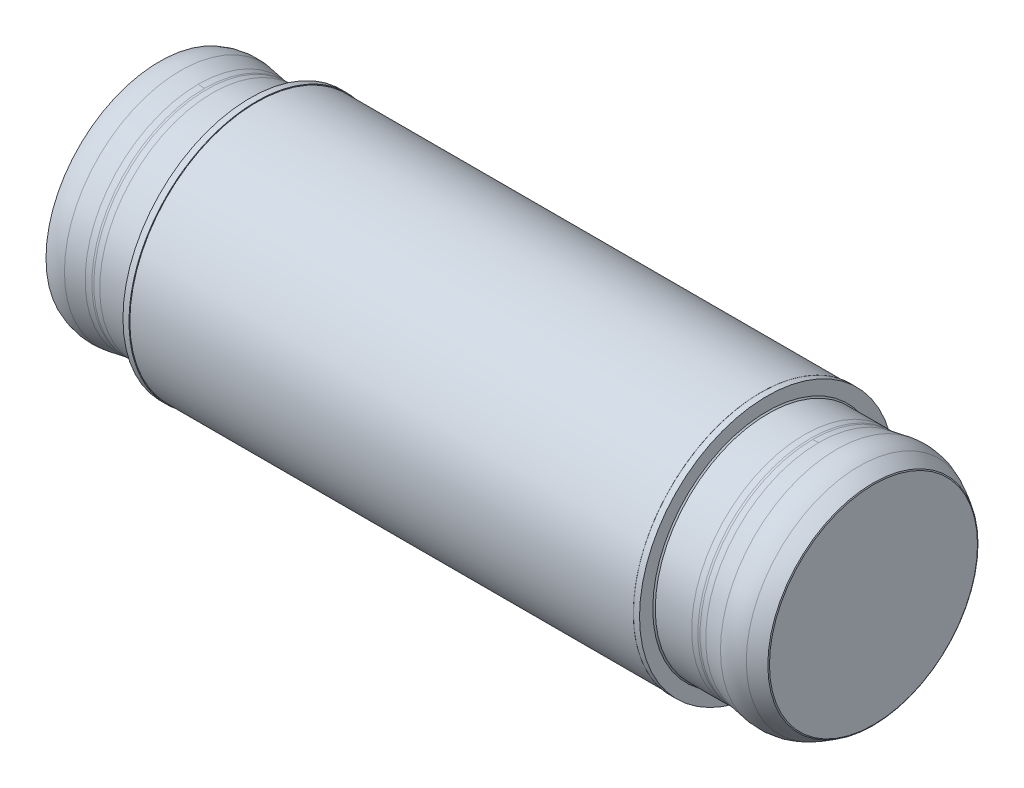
ISO-10303-21;
HEADER;
FILE_DESCRIPTION(('STEP AP214'),'2;1');
FILE_NAME('part.step','',(''),(''),'','','');
FILE_SCHEMA(('AUTOMOTIVE_DESIGN { 1 0 10303 214 1 1 1 1 }'));
ENDSEC;
DATA;
#1=APPLICATION_CONTEXT('core data for automotive mechanical design processes');
#2=APPLICATION_PROTOCOL_DEFINITION('international standard','automotive_design',2000,#1);
#3=PRODUCT_CONTEXT('',#1,'mechanical');
#4=PRODUCT('Part','Part','',(#3));
#5=PRODUCT_RELATED_PRODUCT_CATEGORY('part','',(#4));
#6=PRODUCT_DEFINITION_FORMATION('','',#4);
#7=PRODUCT_DEFINITION_CONTEXT('part definition',#1,'design');
#8=PRODUCT_DEFINITION('design','',#6,#7);
#9=PRODUCT_DEFINITION_SHAPE('','',#8);
#10=(LENGTH_UNIT() NAMED_UNIT(*) SI_UNIT(.MILLI.,.METRE.));
#11=(NAMED_UNIT(*) PLANE_ANGLE_UNIT() SI_UNIT($,.RADIAN.));
#12=(NAMED_UNIT(*) SI_UNIT($,.STERADIAN.) SOLID_ANGLE_UNIT());
#13=UNCERTAINTY_MEASURE_WITH_UNIT(LENGTH_MEASURE(1.E-05),#10,'distance_accuracy_value','');
#14=(GEOMETRIC_REPRESENTATION_CONTEXT(3) GLOBAL_UNCERTAINTY_ASSIGNED_CONTEXT((#13)) GLOBAL_UNIT_ASSIGNED_CONTEXT((#10,
#11,#12)) REPRESENTATION_CONTEXT('',''));
#15=CARTESIAN_POINT('',(0.,0.,0.));
#16=DIRECTION('',(0.,0.,1.));
#17=DIRECTION('',(1.,0.,0.));
#18=AXIS2_PLACEMENT_3D('',#15,#16,#17);
#19=CARTESIAN_POINT('',(527.01861007,83.959351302,-83.959351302));
#20=DIRECTION('',(-1.,0.,0.));
#21=DIRECTION('',(0.,-1.,0.));
#22=AXIS2_PLACEMENT_3D('',#19,#20,#21);
#23=PLANE('',#22);
#24=CARTESIAN_POINT('',(527.01861007,0.,0.));
#25=DIRECTION('',(-1.,0.,0.));
#26=DIRECTION('',(0.,0.,1.));
#27=AXIS2_PLACEMENT_3D('',#24,#25,#26);
#28=CIRCLE('',#27,82.963785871);
#29=CARTESIAN_POINT('',(527.01861007,0.,82.963785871));
#30=VERTEX_POINT('',#29);
#31=EDGE_CURVE('E20',#30,#30,#28,.F.);
#32=ORIENTED_EDGE('',*,*,#31,.T.);
#33=EDGE_LOOP('',(#32));
#34=FACE_BOUND('',#33,.T.);
#35=ADVANCED_FACE('F16',(#34),#23,.F.);
#36=CARTESIAN_POINT('',(527.01861007,0.,0.));
#37=DIRECTION('',(-1.,0.,0.));
#38=DIRECTION('',(0.,0.,1.));
#39=AXIS2_PLACEMENT_3D('',#36,#37,#38);
#40=CONICAL_SURFACE('',#39,82.963785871,1.0739759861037);
#41=CARTESIAN_POINT('',(526.564253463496,0.,0.));
#42=DIRECTION('',(-1.,0.,0.));
#43=DIRECTION('',(0.,1.,0.));
#44=AXIS2_PLACEMENT_3D('',#41,#42,#43);
#45=CIRCLE('',#44,83.8018033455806);
#46=CARTESIAN_POINT('',(526.564253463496,83.8018033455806,0.));
#47=VERTEX_POINT('',#46);
#48=EDGE_CURVE('E123',#47,#47,#45,.F.);
#49=ORIENTED_EDGE('',*,*,#48,.T.);
#50=EDGE_LOOP('',(#49));
#51=FACE_BOUND('',#50,.T.);
#52=ORIENTED_EDGE('',*,*,#31,.F.);
#53=EDGE_LOOP('',(#52));
#54=FACE_BOUND('',#53,.T.);
#55=ADVANCED_FACE('F133',(#51,#54),#40,.T.);
#56=CARTESIAN_POINT('',(472.,0.,0.));
#57=DIRECTION('',(-1.,0.,0.));
#58=DIRECTION('',(0.,-1.,0.));
#59=AXIS2_PLACEMENT_3D('',#56,#57,#58);
#60=SPHERICAL_SURFACE('',#59,100.);
#61=ORIENTED_EDGE('',*,*,#48,.F.);
#62=EDGE_LOOP('',(#61));
#63=FACE_BOUND('',#62,.T.);
#64=CARTESIAN_POINT('',(515.585097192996,0.,0.));
#65=DIRECTION('',(-1.,0.,0.));
#66=DIRECTION('',(0.,0.,1.));
#67=AXIS2_PLACEMENT_3D('',#64,#65,#66);
#68=CIRCLE('',#67,90.0018849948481);
#69=CARTESIAN_POINT('',(515.585097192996,0.,90.0018849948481));
#70=VERTEX_POINT('',#69);
#71=EDGE_CURVE('E119',#70,#70,#68,.T.);
#72=ORIENTED_EDGE('',*,*,#71,.F.);
#73=EDGE_LOOP('',(#72));
#74=FACE_BOUND('',#73,.T.);
#75=ADVANCED_FACE('F128',(#63,#74),#60,.T.);
#76=CARTESIAN_POINT('',(502.509568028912,0.,0.));
#77=DIRECTION('',(-1.,0.,0.));
#78=DIRECTION('',(0.,0.,1.));
#79=AXIS2_PLACEMENT_3D('',#76,#77,#78);
#80=TOROIDAL_SURFACE('',#79,63.0013194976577,30.0000000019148);
#81=CARTESIAN_POINT('',(497.571353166,0.,0.));
#82=DIRECTION('',(1.,0.,0.));
#83=DIRECTION('',(0.,1.,0.));
#84=AXIS2_PLACEMENT_3D('',#81,#82,#83);
#85=CIRCLE('',#84,92.592095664);
#86=CARTESIAN_POINT('',(497.571353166,92.592095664,0.));
#87=VERTEX_POINT('',#86);
#88=EDGE_CURVE('E87',#87,#87,#85,.T.);
#89=ORIENTED_EDGE('',*,*,#88,.T.);
#90=EDGE_LOOP('',(#89));
#91=FACE_BOUND('',#90,.T.);
#92=ORIENTED_EDGE('',*,*,#71,.T.);
#93=EDGE_LOOP('',(#92));
#94=FACE_BOUND('',#93,.T.);
#95=ADVANCED_FACE('F132',(#91,#94),#80,.T.);
#96=CARTESIAN_POINT('',(483.436161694,0.,0.));
#97=DIRECTION('',(1.,0.,0.));
#98=DIRECTION('',(0.,0.,-1.));
#99=AXIS2_PLACEMENT_3D('',#96,#97,#98);
#100=CONICAL_SURFACE('',#99,90.233164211,0.165359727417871);
#101=ORIENTED_EDGE('',*,*,#88,.F.);
#102=EDGE_LOOP('',(#101));
#103=FACE_BOUND('',#102,.T.);
#104=CARTESIAN_POINT('',(483.436161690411,0.,0.));
#105=DIRECTION('',(1.,0.,0.));
#106=DIRECTION('',(0.,0.,-1.));
#107=AXIS2_PLACEMENT_3D('',#104,#105,#106);
#108=CIRCLE('',#107,90.2331642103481);
#109=CARTESIAN_POINT('',(483.436161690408,90.2331642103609,0.));
#110=VERTEX_POINT('',#109);
#111=CARTESIAN_POINT('',(483.436161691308,-90.2331642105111,-9.25356567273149E-09));
#112=VERTEX_POINT('',#111);
#113=EDGE_CURVE('E85',#110,#112,#108,.T.);
#114=ORIENTED_EDGE('',*,*,#113,.T.);
#115=CARTESIAN_POINT('',(483.436161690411,0.,0.));
#116=DIRECTION('',(1.,0.,0.));
#117=DIRECTION('',(0.,0.,-1.));
#118=AXIS2_PLACEMENT_3D('',#115,#116,#117);
#119=CIRCLE('',#118,90.2331642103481);
#120=EDGE_CURVE('E79',#112,#110,#119,.T.);
#121=ORIENTED_EDGE('',*,*,#120,.T.);
#122=EDGE_LOOP('',(#114,#121));
#123=FACE_BOUND('',#122,.T.);
#124=ADVANCED_FACE('F84',(#103,#123),#100,.T.);
#125=CARTESIAN_POINT('',(486.365639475,90.8739937,0.));
#126=CARTESIAN_POINT('',(486.365639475,90.8739937,-181.7479874));
#127=CARTESIAN_POINT('',(486.365639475,-90.8739937,-181.7479874));
#128=CARTESIAN_POINT('',(486.365639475,-90.8739937,0.));
#129=CARTESIAN_POINT('',(482.820171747,89.910446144,0.));
#130=CARTESIAN_POINT('',(482.820171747,89.910446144,-179.820892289));
#131=CARTESIAN_POINT('',(482.820171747,-89.910446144,-179.820892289));
#132=CARTESIAN_POINT('',(482.820171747,-89.910446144,0.));
#133=CARTESIAN_POINT('',(479.158655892,89.607020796,0.));
#134=CARTESIAN_POINT('',(479.158655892,89.607020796,-179.214041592));
#135=CARTESIAN_POINT('',(479.158655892,-89.607020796,-179.214041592));
#136=CARTESIAN_POINT('',(479.158655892,-89.607020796,0.));
#137=CARTESIAN_POINT('',(475.502944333,89.973815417,0.));
#138=CARTESIAN_POINT('',(475.502944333,89.973815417,-179.947630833));
#139=CARTESIAN_POINT('',(475.502944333,-89.973815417,-179.947630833));
#140=CARTESIAN_POINT('',(475.502944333,-89.973815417,0.));
#141=(BOUNDED_SURFACE() B_SPLINE_SURFACE(3,3,((#125,#126,#127,#128),(#129,#130,#131,#132),(#133,
#134,#135,#136),(#137,#138,#139,#140)),.UNSPECIFIED.,.F.,.F.,
.F.) B_SPLINE_SURFACE_WITH_KNOTS((4,4),(4,4),(0.,1.),(0.,1.),
.UNSPECIFIED.) GEOMETRIC_REPRESENTATION_ITEM() RATIONAL_B_SPLINE_SURFACE(((1.,0.333333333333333,
0.333333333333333,1.),(0.988906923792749,0.32963564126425,0.32963564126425,0.988906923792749),
(0.988906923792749,0.32963564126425,0.32963564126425,0.988906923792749),(1.,0.333333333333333,
0.333333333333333,1.))) REPRESENTATION_ITEM('') SURFACE());
#142=CARTESIAN_POINT('',(486.365639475,90.8739937,0.));
#143=CARTESIAN_POINT('',(482.820171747,89.910446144,0.));
#144=CARTESIAN_POINT('',(479.158655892,89.607020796,0.));
#145=CARTESIAN_POINT('',(475.502944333,89.973815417,0.));
#146=(BOUNDED_CURVE() B_SPLINE_CURVE(3,(#142,#143,#144,#145),.UNSPECIFIED.,.F.,
.F.) B_SPLINE_CURVE_WITH_KNOTS((4,4),(0.,1.),
.UNSPECIFIED.) CURVE() GEOMETRIC_REPRESENTATION_ITEM() RATIONAL_B_SPLINE_CURVE((1.,
0.988906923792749,0.988906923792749,1.)) REPRESENTATION_ITEM(''));
#147=CARTESIAN_POINT('',(478.497946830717,89.8239403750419,0.));
#148=VERTEX_POINT('',#147);
#149=EDGE_CURVE('E86',#148,#110,#146,.F.);
#150=CARTESIAN_POINT('',(486.365639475,-90.8739937,0.));
#151=CARTESIAN_POINT('',(482.820171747,-89.910446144,0.));
#152=CARTESIAN_POINT('',(479.158655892,-89.607020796,0.));
#153=CARTESIAN_POINT('',(475.502944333,-89.973815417,0.));
#154=(BOUNDED_CURVE() B_SPLINE_CURVE(3,(#150,#151,#152,#153),.UNSPECIFIED.,.F.,
.F.) B_SPLINE_CURVE_WITH_KNOTS((4,4),(0.,1.),
.UNSPECIFIED.) CURVE() GEOMETRIC_REPRESENTATION_ITEM() RATIONAL_B_SPLINE_CURVE((1.,
0.988906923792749,0.988906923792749,1.)) REPRESENTATION_ITEM(''));
#155=CARTESIAN_POINT('',(478.497946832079,-89.8239403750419,0.));
#156=VERTEX_POINT('',#155);
#157=EDGE_CURVE('E93',#112,#156,#154,.T.);
#158=CARTESIAN_POINT('',(478.497946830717,0.,0.));
#159=DIRECTION('',(1.,0.,0.));
#160=DIRECTION('',(0.,0.,-1.));
#161=AXIS2_PLACEMENT_3D('',#158,#159,#160);
#162=CIRCLE('',#161,89.8239403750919);
#163=EDGE_CURVE('E96',#156,#148,#162,.T.);
#164=ORIENTED_EDGE('',*,*,#149,.T.);
#165=ORIENTED_EDGE('',*,*,#120,.F.);
#166=ORIENTED_EDGE('',*,*,#157,.T.);
#167=ORIENTED_EDGE('',*,*,#163,.T.);
#168=EDGE_LOOP('',(#164,#165,#166,#167));
#169=FACE_BOUND('',#168,.T.);
#170=ADVANCED_FACE('F95',(#169),#141,.F.);
#171=CARTESIAN_POINT('',(486.365639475,-90.8739937,0.));
#172=CARTESIAN_POINT('',(486.365639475,-90.8739937,181.7479874));
#173=CARTESIAN_POINT('',(486.365639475,90.8739937,181.7479874));
#174=CARTESIAN_POINT('',(486.365639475,90.8739937,0.));
#175=CARTESIAN_POINT('',(482.820171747,-89.910446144,0.));
#176=CARTESIAN_POINT('',(482.820171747,-89.910446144,179.820892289));
#177=CARTESIAN_POINT('',(482.820171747,89.910446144,179.820892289));
#178=CARTESIAN_POINT('',(482.820171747,89.910446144,0.));
#179=CARTESIAN_POINT('',(479.158655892,-89.607020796,0.));
#180=CARTESIAN_POINT('',(479.158655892,-89.607020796,179.214041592));
#181=CARTESIAN_POINT('',(479.158655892,89.607020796,179.214041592));
#182=CARTESIAN_POINT('',(479.158655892,89.607020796,0.));
#183=CARTESIAN_POINT('',(475.502944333,-89.973815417,0.));
#184=CARTESIAN_POINT('',(475.502944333,-89.973815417,179.947630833));
#185=CARTESIAN_POINT('',(475.502944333,89.973815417,179.947630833));
#186=CARTESIAN_POINT('',(475.502944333,89.973815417,0.));
#187=(BOUNDED_SURFACE() B_SPLINE_SURFACE(3,3,((#171,#172,#173,#174),(#175,#176,#177,#178),(#179,
#180,#181,#182),(#183,#184,#185,#186)),.UNSPECIFIED.,.F.,.F.,
.F.) B_SPLINE_SURFACE_WITH_KNOTS((4,4),(4,4),(0.,1.),(0.,1.),
.UNSPECIFIED.) GEOMETRIC_REPRESENTATION_ITEM() RATIONAL_B_SPLINE_SURFACE(((1.,0.333333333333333,
0.333333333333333,1.),(0.988906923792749,0.32963564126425,0.32963564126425,0.988906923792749),
(0.988906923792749,0.32963564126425,0.32963564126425,0.988906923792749),(1.,0.333333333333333,
0.333333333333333,1.))) REPRESENTATION_ITEM('') SURFACE());
#188=CARTESIAN_POINT('',(478.497946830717,0.,0.));
#189=DIRECTION('',(1.,0.,0.));
#190=DIRECTION('',(0.,0.,-1.));
#191=AXIS2_PLACEMENT_3D('',#188,#189,#190);
#192=CIRCLE('',#191,89.8239403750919);
#193=EDGE_CURVE('E256',#148,#156,#192,.T.);
#194=ORIENTED_EDGE('',*,*,#157,.F.);
#195=ORIENTED_EDGE('',*,*,#113,.F.);
#196=ORIENTED_EDGE('',*,*,#149,.F.);
#197=ORIENTED_EDGE('',*,*,#193,.T.);
#198=EDGE_LOOP('',(#194,#195,#196,#197));
#199=FACE_BOUND('',#198,.T.);
#200=ADVANCED_FACE('F90',(#199),#187,.F.);
#201=CARTESIAN_POINT('',(478.497946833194,0.,0.));
#202=DIRECTION('',(-1.,0.,0.));
#203=DIRECTION('',(0.,0.,1.));
#204=AXIS2_PLACEMENT_3D('',#201,#202,#203);
#205=TOROIDAL_SURFACE('',#204,119.82394035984,29.9999999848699);
#206=ORIENTED_EDGE('',*,*,#193,.F.);
#207=ORIENTED_EDGE('',*,*,#163,.F.);
#208=EDGE_LOOP('',(#206,#207));
#209=FACE_BOUND('',#208,.T.);
#210=CARTESIAN_POINT('',(476.87346104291,0.,0.));
#211=DIRECTION('',(-1.,0.,0.));
#212=DIRECTION('',(0.,1.,0.));
#213=AXIS2_PLACEMENT_3D('',#210,#211,#212);
#214=CIRCLE('',#213,89.8679552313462);
#215=CARTESIAN_POINT('',(476.87346104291,89.8679552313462,0.));
#216=VERTEX_POINT('',#215);
#217=EDGE_CURVE('E253',#216,#216,#214,.F.);
#218=ORIENTED_EDGE('',*,*,#217,.T.);
#219=EDGE_LOOP('',(#218));
#220=FACE_BOUND('',#219,.T.);
#221=ADVANCED_FACE('F145',(#209,#220),#205,.F.);
#222=CARTESIAN_POINT('',(472.,0.,0.));
#223=DIRECTION('',(-1.,0.,0.));
#224=DIRECTION('',(0.,-1.,0.));
#225=AXIS2_PLACEMENT_3D('',#222,#223,#224);
#226=SPHERICAL_SURFACE('',#225,90.);
#227=ORIENTED_EDGE('',*,*,#217,.F.);
#228=EDGE_LOOP('',(#227));
#229=FACE_BOUND('',#228,.T.);
#230=CARTESIAN_POINT('',(472.,0.,0.));
#231=DIRECTION('',(-1.,0.,0.));
#232=DIRECTION('',(0.,-1.,0.));
#233=AXIS2_PLACEMENT_3D('',#230,#231,#232);
#234=CIRCLE('',#233,90.);
#235=CARTESIAN_POINT('',(472.,-90.,0.));
#236=VERTEX_POINT('',#235);
#237=EDGE_CURVE('E250',#236,#236,#234,.F.);
#238=ORIENTED_EDGE('',*,*,#237,.T.);
#239=EDGE_LOOP('',(#238));
#240=FACE_BOUND('',#239,.T.);
#241=ADVANCED_FACE('F148',(#229,#240),#226,.T.);
#242=CARTESIAN_POINT('',(472.,0.,0.));
#243=DIRECTION('',(-1.,0.,0.));
#244=DIRECTION('',(0.,0.,1.));
#245=AXIS2_PLACEMENT_3D('',#242,#243,#244);
#246=CYLINDRICAL_SURFACE('',#245,90.);
#247=CARTESIAN_POINT('',(443.,0.,0.));
#248=DIRECTION('',(-1.,0.,0.));
#249=DIRECTION('',(0.,-1.,0.));
#250=AXIS2_PLACEMENT_3D('',#247,#248,#249);
#251=CIRCLE('',#250,90.);
#252=CARTESIAN_POINT('',(443.,-90.,0.));
#253=VERTEX_POINT('',#252);
#254=EDGE_CURVE('E248',#253,#253,#251,.F.);
#255=ORIENTED_EDGE('',*,*,#254,.T.);
#256=EDGE_LOOP('',(#255));
#257=FACE_BOUND('',#256,.T.);
#258=ORIENTED_EDGE('',*,*,#237,.F.);
#259=EDGE_LOOP('',(#258));
#260=FACE_BOUND('',#259,.T.);
#261=ADVANCED_FACE('F234',(#257,#260),#246,.T.);
#262=CARTESIAN_POINT('',(443.,0.,0.));
#263=DIRECTION('',(-1.,0.,0.));
#264=DIRECTION('',(0.,0.,1.));
#265=AXIS2_PLACEMENT_3D('',#262,#263,#264);
#266=CONICAL_SURFACE('',#265,90.,0.785398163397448);
#267=CARTESIAN_POINT('',(442.,0.,0.));
#268=DIRECTION('',(-1.,0.,0.));
#269=DIRECTION('',(0.,0.,1.));
#270=AXIS2_PLACEMENT_3D('',#267,#268,#269);
#271=CIRCLE('',#270,91.0000000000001);
#272=CARTESIAN_POINT('',(442.,0.,91.0000000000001));
#273=VERTEX_POINT('',#272);
#274=EDGE_CURVE('E268',#273,#273,#271,.F.);
#275=ORIENTED_EDGE('',*,*,#274,.T.);
#276=EDGE_LOOP('',(#275));
#277=FACE_BOUND('',#276,.T.);
#278=ORIENTED_EDGE('',*,*,#254,.F.);
#279=EDGE_LOOP('',(#278));
#280=FACE_BOUND('',#279,.T.);
#281=ADVANCED_FACE('F154',(#277,#280),#266,.T.);
#282=CARTESIAN_POINT('',(442.,102.782262,-102.782262));
#283=DIRECTION('',(-1.,0.,0.));
#284=DIRECTION('',(0.,-1.,0.));
#285=AXIS2_PLACEMENT_3D('',#282,#283,#284);
#286=PLANE('',#285);
#287=ORIENTED_EDGE('',*,*,#274,.F.);
#288=EDGE_LOOP('',(#287));
#289=FACE_BOUND('',#288,.T.);
#290=CARTESIAN_POINT('',(442.,0.,0.));
#291=DIRECTION('',(-1.,0.,0.));
#292=DIRECTION('',(0.,0.,1.));
#293=AXIS2_PLACEMENT_3D('',#290,#291,#292);
#294=CIRCLE('',#293,101.5635);
#295=CARTESIAN_POINT('',(442.,0.,101.5635));
#296=VERTEX_POINT('',#295);
#297=EDGE_CURVE('E271',#296,#296,#294,.F.);
#298=ORIENTED_EDGE('',*,*,#297,.T.);
#299=EDGE_LOOP('',(#298));
#300=FACE_BOUND('',#299,.T.);
#301=ADVANCED_FACE('F150',(#289,#300),#286,.F.);
#302=CARTESIAN_POINT('',(442.,0.,0.));
#303=DIRECTION('',(-1.,0.,0.));
#304=DIRECTION('',(0.,0.,1.));
#305=AXIS2_PLACEMENT_3D('',#302,#303,#304);
#306=CYLINDRICAL_SURFACE('',#305,101.5635);
#307=CARTESIAN_POINT('',(437.199999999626,0.,0.));
#308=DIRECTION('',(-1.,0.,0.));
#309=DIRECTION('',(0.,0.,1.));
#310=AXIS2_PLACEMENT_3D('',#307,#308,#309);
#311=CIRCLE('',#310,101.563500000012);
#312=CARTESIAN_POINT('',(437.199999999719,-101.563500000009,0.));
#313=VERTEX_POINT('',#312);
#314=CARTESIAN_POINT('',(437.199999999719,101.563500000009,-1.04155110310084E-08));
#315=VERTEX_POINT('',#314);
#316=EDGE_CURVE('E397',#313,#315,#311,.T.);
#317=ORIENTED_EDGE('',*,*,#316,.F.);
#318=CARTESIAN_POINT('',(437.199999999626,0.,0.));
#319=DIRECTION('',(-1.,0.,0.));
#320=DIRECTION('',(0.,0.,1.));
#321=AXIS2_PLACEMENT_3D('',#318,#319,#320);
#322=CIRCLE('',#321,101.563500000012);
#323=EDGE_CURVE('E207',#315,#313,#322,.T.);
#324=ORIENTED_EDGE('',*,*,#323,.F.);
#325=EDGE_LOOP('',(#317,#324));
#326=FACE_BOUND('',#325,.T.);
#327=ORIENTED_EDGE('',*,*,#297,.F.);
#328=EDGE_LOOP('',(#327));
#329=FACE_BOUND('',#328,.T.);
#330=ADVANCED_FACE('F153',(#326,#329),#306,.T.);
#331=CARTESIAN_POINT('',(437.000999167,101.343533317,0.));
#332=CARTESIAN_POINT('',(437.000999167,101.343533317,-202.687066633));
#333=CARTESIAN_POINT('',(437.000999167,-101.343533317,-202.687066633));
#334=CARTESIAN_POINT('',(437.000999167,-101.343533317,0.));
#335=CARTESIAN_POINT('',(436.987355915,101.479510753,0.));
#336=CARTESIAN_POINT('',(436.987355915,101.479510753,-202.959021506));
#337=CARTESIAN_POINT('',(436.987355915,-101.479510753,-202.959021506));
#338=CARTESIAN_POINT('',(436.987355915,-101.479510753,0.));
#339=CARTESIAN_POINT('',(437.083989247,101.576144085,0.));
#340=CARTESIAN_POINT('',(437.083989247,101.576144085,-203.152288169));
#341=CARTESIAN_POINT('',(437.083989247,-101.576144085,-203.152288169));
#342=CARTESIAN_POINT('',(437.083989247,-101.576144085,0.));
#343=CARTESIAN_POINT('',(437.219966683,101.562500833,0.));
#344=CARTESIAN_POINT('',(437.219966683,101.562500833,-203.125001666));
#345=CARTESIAN_POINT('',(437.219966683,-101.562500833,-203.125001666));
#346=CARTESIAN_POINT('',(437.219966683,-101.562500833,0.));
#347=(BOUNDED_SURFACE() B_SPLINE_SURFACE(3,3,((#331,#332,#333,#334),(#335,#336,#337,#338),(#339,
#340,#341,#342),(#343,#344,#345,#346)),.UNSPECIFIED.,.F.,.F.,
.F.) B_SPLINE_SURFACE_WITH_KNOTS((4,4),(4,4),(0.,1.),(0.,1.),
.UNSPECIFIED.) GEOMETRIC_REPRESENTATION_ITEM() RATIONAL_B_SPLINE_SURFACE(((1.,0.333333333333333,
0.333333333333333,1.),(0.75532087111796,0.251773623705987,0.251773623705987,0.75532087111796),
(0.75532087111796,0.251773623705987,0.251773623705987,0.75532087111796),(1.,0.333333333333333,
0.333333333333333,1.))) REPRESENTATION_ITEM('') SURFACE());
#348=CARTESIAN_POINT('',(437.000999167,-101.343533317,0.));
#349=CARTESIAN_POINT('',(436.987355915,-101.479510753,0.));
#350=CARTESIAN_POINT('',(437.083989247,-101.576144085,0.));
#351=CARTESIAN_POINT('',(437.219966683,-101.562500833,0.));
#352=(BOUNDED_CURVE() B_SPLINE_CURVE(3,(#348,#349,#350,#351),.UNSPECIFIED.,.F.,
.F.) B_SPLINE_CURVE_WITH_KNOTS((4,4),(0.,1.),
.UNSPECIFIED.) CURVE() GEOMETRIC_REPRESENTATION_ITEM() RATIONAL_B_SPLINE_CURVE((1.,
0.75532087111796,0.75532087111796,1.)) REPRESENTATION_ITEM(''));
#353=CARTESIAN_POINT('',(436.999999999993,-101.363499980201,0.));
#354=VERTEX_POINT('',#353);
#355=EDGE_CURVE('E196',#354,#313,#352,.T.);
#356=CARTESIAN_POINT('',(436.999999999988,-101.363500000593,0.));
#357=CARTESIAN_POINT('',(436.999999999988,-101.363500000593,-202.727000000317));
#358=CARTESIAN_POINT('',(436.999999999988,101.363500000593,-202.727000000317));
#359=CARTESIAN_POINT('',(436.999999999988,101.363500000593,0.));
#360=(BOUNDED_CURVE() B_SPLINE_CURVE(3,(#356,#357,#358,#359),.UNSPECIFIED.,.F.,
.F.) B_SPLINE_CURVE_WITH_KNOTS((4,4),(0.,1.),
.UNSPECIFIED.) CURVE() GEOMETRIC_REPRESENTATION_ITEM() RATIONAL_B_SPLINE_CURVE((0.956578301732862,
0.318859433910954,0.318859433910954,0.956578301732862)) REPRESENTATION_ITEM(''));
#361=CARTESIAN_POINT('',(436.999999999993,101.363499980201,0.));
#362=VERTEX_POINT('',#361);
#363=EDGE_CURVE('E185',#354,#362,#360,.T.);
#364=CARTESIAN_POINT('',(437.000999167,101.343533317,0.));
#365=CARTESIAN_POINT('',(436.987355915,101.479510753,0.));
#366=CARTESIAN_POINT('',(437.083989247,101.576144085,0.));
#367=CARTESIAN_POINT('',(437.219966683,101.562500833,0.));
#368=(BOUNDED_CURVE() B_SPLINE_CURVE(3,(#364,#365,#366,#367),.UNSPECIFIED.,.F.,
.F.) B_SPLINE_CURVE_WITH_KNOTS((4,4),(0.,1.),
.UNSPECIFIED.) CURVE() GEOMETRIC_REPRESENTATION_ITEM() RATIONAL_B_SPLINE_CURVE((1.,
0.75532087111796,0.75532087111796,1.)) REPRESENTATION_ITEM(''));
#369=EDGE_CURVE('E195',#315,#362,#368,.F.);
#370=ORIENTED_EDGE('',*,*,#355,.F.);
#371=ORIENTED_EDGE('',*,*,#363,.T.);
#372=ORIENTED_EDGE('',*,*,#369,.F.);
#373=ORIENTED_EDGE('',*,*,#323,.T.);
#374=EDGE_LOOP('',(#370,#371,#372,#373));
#375=FACE_BOUND('',#374,.T.);
#376=ADVANCED_FACE('F194',(#375),#347,.T.);
#377=CARTESIAN_POINT('',(437.000999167,-101.343533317,0.));
#378=CARTESIAN_POINT('',(437.000999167,-101.343533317,202.687066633));
#379=CARTESIAN_POINT('',(437.000999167,101.343533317,202.687066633));
#380=CARTESIAN_POINT('',(437.000999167,101.343533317,0.));
#381=CARTESIAN_POINT('',(436.987355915,-101.479510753,0.));
#382=CARTESIAN_POINT('',(436.987355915,-101.479510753,202.959021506));
#383=CARTESIAN_POINT('',(436.987355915,101.479510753,202.959021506));
#384=CARTESIAN_POINT('',(436.987355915,101.479510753,0.));
#385=CARTESIAN_POINT('',(437.083989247,-101.576144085,0.));
#386=CARTESIAN_POINT('',(437.083989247,-101.576144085,203.152288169));
#387=CARTESIAN_POINT('',(437.083989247,101.576144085,203.152288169));
#388=CARTESIAN_POINT('',(437.083989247,101.576144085,0.));
#389=CARTESIAN_POINT('',(437.219966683,-101.562500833,0.));
#390=CARTESIAN_POINT('',(437.219966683,-101.562500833,203.125001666));
#391=CARTESIAN_POINT('',(437.219966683,101.562500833,203.125001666));
#392=CARTESIAN_POINT('',(437.219966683,101.562500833,0.));
#393=(BOUNDED_SURFACE() B_SPLINE_SURFACE(3,3,((#377,#378,#379,#380),(#381,#382,#383,#384),(#385,
#386,#387,#388),(#389,#390,#391,#392)),.UNSPECIFIED.,.F.,.F.,
.F.) B_SPLINE_SURFACE_WITH_KNOTS((4,4),(4,4),(0.,1.),(0.,1.),
.UNSPECIFIED.) GEOMETRIC_REPRESENTATION_ITEM() RATIONAL_B_SPLINE_SURFACE(((1.,0.333333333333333,
0.333333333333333,1.),(0.75532087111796,0.251773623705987,0.251773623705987,0.75532087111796),
(0.75532087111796,0.251773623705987,0.251773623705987,0.75532087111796),(1.,0.333333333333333,
0.333333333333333,1.))) REPRESENTATION_ITEM('') SURFACE());
#394=CARTESIAN_POINT('',(436.999999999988,101.363500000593,0.));
#395=CARTESIAN_POINT('',(436.999999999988,101.363500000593,202.727000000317));
#396=CARTESIAN_POINT('',(436.999999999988,-101.363500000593,202.727000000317));
#397=CARTESIAN_POINT('',(436.999999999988,-101.363500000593,0.));
#398=(BOUNDED_CURVE() B_SPLINE_CURVE(3,(#394,#395,#396,#397),.UNSPECIFIED.,.F.,
.F.) B_SPLINE_CURVE_WITH_KNOTS((4,4),(0.,1.),
.UNSPECIFIED.) CURVE() GEOMETRIC_REPRESENTATION_ITEM() RATIONAL_B_SPLINE_CURVE((0.956578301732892,
0.318859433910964,0.318859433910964,0.956578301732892)) REPRESENTATION_ITEM(''));
#399=EDGE_CURVE('E183',#362,#354,#398,.T.);
#400=ORIENTED_EDGE('',*,*,#399,.T.);
#401=ORIENTED_EDGE('',*,*,#355,.T.);
#402=ORIENTED_EDGE('',*,*,#316,.T.);
#403=ORIENTED_EDGE('',*,*,#369,.T.);
#404=EDGE_LOOP('',(#400,#401,#402,#403));
#405=FACE_BOUND('',#404,.T.);
#406=ADVANCED_FACE('F161',(#405),#393,.T.);
#407=CARTESIAN_POINT('',(437.,-102.579862,-102.579862));
#408=DIRECTION('',(1.,0.,0.));
#409=DIRECTION('',(0.,1.,0.));
#410=AXIS2_PLACEMENT_3D('',#407,#408,#409);
#411=PLANE('',#410);
#412=CARTESIAN_POINT('',(437.,0.,0.));
#413=DIRECTION('',(-1.,0.,0.));
#414=DIRECTION('',(0.,0.,1.));
#415=AXIS2_PLACEMENT_3D('',#412,#413,#414);
#416=CIRCLE('',#415,101.);
#417=CARTESIAN_POINT('',(437.,0.,101.));
#418=VERTEX_POINT('',#417);
#419=EDGE_CURVE('E190',#418,#418,#416,.F.);
#420=ORIENTED_EDGE('',*,*,#419,.T.);
#421=EDGE_LOOP('',(#420));
#422=FACE_BOUND('',#421,.T.);
#423=ORIENTED_EDGE('',*,*,#363,.F.);
#424=ORIENTED_EDGE('',*,*,#399,.F.);
#425=EDGE_LOOP('',(#423,#424));
#426=FACE_BOUND('',#425,.T.);
#427=ADVANCED_FACE('F156',(#422,#426),#411,.F.);
#428=CARTESIAN_POINT('',(437.,0.,0.));
#429=DIRECTION('',(-1.,0.,0.));
#430=DIRECTION('',(0.,0.,1.));
#431=AXIS2_PLACEMENT_3D('',#428,#429,#430);
#432=CYLINDRICAL_SURFACE('',#431,101.);
#433=CARTESIAN_POINT('',(35.,0.,0.));
#434=DIRECTION('',(-1.,0.,0.));
#435=DIRECTION('',(0.,0.,1.));
#436=AXIS2_PLACEMENT_3D('',#433,#434,#435);
#437=CIRCLE('',#436,101.);
#438=CARTESIAN_POINT('',(35.,0.,101.));
#439=VERTEX_POINT('',#438);
#440=EDGE_CURVE('E278',#439,#439,#437,.F.);
#441=ORIENTED_EDGE('',*,*,#440,.T.);
#442=EDGE_LOOP('',(#441));
#443=FACE_BOUND('',#442,.T.);
#444=ORIENTED_EDGE('',*,*,#419,.F.);
#445=EDGE_LOOP('',(#444));
#446=FACE_BOUND('',#445,.T.);
#447=ADVANCED_FACE('F160',(#443,#446),#432,.T.);
#448=CARTESIAN_POINT('',(35.,102.5156,-102.5156));
#449=DIRECTION('',(-1.,0.,0.));
#450=DIRECTION('',(0.,-1.,0.));
#451=AXIS2_PLACEMENT_3D('',#448,#449,#450);
#452=PLANE('',#451);
#453=ORIENTED_EDGE('',*,*,#440,.F.);
#454=EDGE_LOOP('',(#453));
#455=FACE_BOUND('',#454,.T.);
#456=CARTESIAN_POINT('',(35.0000000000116,101.300000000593,0.));
#457=CARTESIAN_POINT('',(35.0000000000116,101.300000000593,-202.600000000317));
#458=CARTESIAN_POINT('',(35.0000000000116,-101.300000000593,-202.600000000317));
#459=CARTESIAN_POINT('',(35.0000000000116,-101.300000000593,0.));
#460=(BOUNDED_CURVE() B_SPLINE_CURVE(3,(#456,#457,#458,#459),.UNSPECIFIED.,.F.,
.F.) B_SPLINE_CURVE_WITH_KNOTS((4,4),(0.,1.),
.UNSPECIFIED.) CURVE() GEOMETRIC_REPRESENTATION_ITEM() RATIONAL_B_SPLINE_CURVE((0.956578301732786,
0.318859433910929,0.318859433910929,0.956578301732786)) REPRESENTATION_ITEM(''));
#461=CARTESIAN_POINT('',(35.000000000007,101.299999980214,0.));
#462=VERTEX_POINT('',#461);
#463=CARTESIAN_POINT('',(35.000000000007,-101.299999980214,0.));
#464=VERTEX_POINT('',#463);
#465=EDGE_CURVE('E281',#462,#464,#460,.T.);
#466=ORIENTED_EDGE('',*,*,#465,.F.);
#467=CARTESIAN_POINT('',(35.0000000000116,-101.300000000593,0.));
#468=CARTESIAN_POINT('',(35.0000000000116,-101.300000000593,202.600000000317));
#469=CARTESIAN_POINT('',(35.0000000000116,101.300000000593,202.600000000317));
#470=CARTESIAN_POINT('',(35.0000000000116,101.300000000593,0.));
#471=(BOUNDED_CURVE() B_SPLINE_CURVE(3,(#467,#468,#469,#470),.UNSPECIFIED.,.F.,
.F.) B_SPLINE_CURVE_WITH_KNOTS((4,4),(0.,1.),
.UNSPECIFIED.) CURVE() GEOMETRIC_REPRESENTATION_ITEM() RATIONAL_B_SPLINE_CURVE((0.956578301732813,
0.318859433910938,0.318859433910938,0.956578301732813)) REPRESENTATION_ITEM(''));
#472=EDGE_CURVE('E306',#464,#462,#471,.T.);
#473=ORIENTED_EDGE('',*,*,#472,.F.);
#474=EDGE_LOOP('',(#466,#473));
#475=FACE_BOUND('',#474,.T.);
#476=ADVANCED_FACE('F163',(#455,#475),#452,.F.);
#477=CARTESIAN_POINT('',(34.780033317,101.499000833,0.));
#478=CARTESIAN_POINT('',(34.780033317,101.499000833,-202.998001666));
#479=CARTESIAN_POINT('',(34.780033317,-101.499000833,-202.998001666));
#480=CARTESIAN_POINT('',(34.780033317,-101.499000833,0.));
#481=CARTESIAN_POINT('',(34.916010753,101.512644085,0.));
#482=CARTESIAN_POINT('',(34.916010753,101.512644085,-203.025288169));
#483=CARTESIAN_POINT('',(34.916010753,-101.512644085,-203.025288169));
#484=CARTESIAN_POINT('',(34.916010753,-101.512644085,0.));
#485=CARTESIAN_POINT('',(35.012644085,101.416010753,0.));
#486=CARTESIAN_POINT('',(35.012644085,101.416010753,-202.832021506));
#487=CARTESIAN_POINT('',(35.012644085,-101.416010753,-202.832021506));
#488=CARTESIAN_POINT('',(35.012644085,-101.416010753,0.));
#489=CARTESIAN_POINT('',(34.999000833,101.280033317,0.));
#490=CARTESIAN_POINT('',(34.999000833,101.280033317,-202.560066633));
#491=CARTESIAN_POINT('',(34.999000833,-101.280033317,-202.560066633));
#492=CARTESIAN_POINT('',(34.999000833,-101.280033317,0.));
#493=(BOUNDED_SURFACE() B_SPLINE_SURFACE(3,3,((#477,#478,#479,#480),(#481,#482,#483,#484),(#485,
#486,#487,#488),(#489,#490,#491,#492)),.UNSPECIFIED.,.F.,.F.,
.F.) B_SPLINE_SURFACE_WITH_KNOTS((4,4),(4,4),(0.,1.),(0.,1.),
.UNSPECIFIED.) GEOMETRIC_REPRESENTATION_ITEM() RATIONAL_B_SPLINE_SURFACE(((1.,0.333333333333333,
0.333333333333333,1.),(0.755320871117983,0.251773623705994,0.251773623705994,0.755320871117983),
(0.755320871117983,0.251773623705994,0.251773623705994,0.755320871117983),(1.,0.333333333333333,
0.333333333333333,1.))) REPRESENTATION_ITEM('') SURFACE());
#494=CARTESIAN_POINT('',(34.780033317,-101.499000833,0.));
#495=CARTESIAN_POINT('',(34.916010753,-101.512644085,0.));
#496=CARTESIAN_POINT('',(35.012644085,-101.416010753,0.));
#497=CARTESIAN_POINT('',(34.999000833,-101.280033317,0.));
#498=(BOUNDED_CURVE() B_SPLINE_CURVE(3,(#494,#495,#496,#497),.UNSPECIFIED.,.F.,
.F.) B_SPLINE_CURVE_WITH_KNOTS((4,4),(0.,1.),
.UNSPECIFIED.) CURVE() GEOMETRIC_REPRESENTATION_ITEM() RATIONAL_B_SPLINE_CURVE((1.,
0.755320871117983,0.755320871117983,1.)) REPRESENTATION_ITEM(''));
#499=CARTESIAN_POINT('',(34.8,-101.500000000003,-4.5570266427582E-09));
#500=VERTEX_POINT('',#499);
#501=EDGE_CURVE('E326',#500,#464,#498,.T.);
#502=CARTESIAN_POINT('',(34.8,0.,0.));
#503=DIRECTION('',(-1.,0.,0.));
#504=DIRECTION('',(0.,-1.,0.));
#505=AXIS2_PLACEMENT_3D('',#502,#503,#504);
#506=CIRCLE('',#505,101.5);
#507=CARTESIAN_POINT('',(34.8,101.500000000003,-3.12269969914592E-08));
#508=VERTEX_POINT('',#507);
#509=EDGE_CURVE('E322',#500,#508,#506,.F.);
#510=CARTESIAN_POINT('',(34.780033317,101.499000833,0.));
#511=CARTESIAN_POINT('',(34.916010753,101.512644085,0.));
#512=CARTESIAN_POINT('',(35.012644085,101.416010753,0.));
#513=CARTESIAN_POINT('',(34.999000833,101.280033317,0.));
#514=(BOUNDED_CURVE() B_SPLINE_CURVE(3,(#510,#511,#512,#513),.UNSPECIFIED.,.F.,
.F.) B_SPLINE_CURVE_WITH_KNOTS((4,4),(0.,1.),
.UNSPECIFIED.) CURVE() GEOMETRIC_REPRESENTATION_ITEM() RATIONAL_B_SPLINE_CURVE((1.,
0.755320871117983,0.755320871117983,1.)) REPRESENTATION_ITEM(''));
#515=EDGE_CURVE('E320',#462,#508,#514,.F.);
#516=ORIENTED_EDGE('',*,*,#501,.F.);
#517=ORIENTED_EDGE('',*,*,#509,.T.);
#518=ORIENTED_EDGE('',*,*,#515,.F.);
#519=ORIENTED_EDGE('',*,*,#465,.T.);
#520=EDGE_LOOP('',(#516,#517,#518,#519));
#521=FACE_BOUND('',#520,.T.);
#522=ADVANCED_FACE('F321',(#521),#493,.T.);
#523=CARTESIAN_POINT('',(34.780033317,-101.499000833,0.));
#524=CARTESIAN_POINT('',(34.780033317,-101.499000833,202.998001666));
#525=CARTESIAN_POINT('',(34.780033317,101.499000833,202.998001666));
#526=CARTESIAN_POINT('',(34.780033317,101.499000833,0.));
#527=CARTESIAN_POINT('',(34.916010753,-101.512644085,0.));
#528=CARTESIAN_POINT('',(34.916010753,-101.512644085,203.025288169));
#529=CARTESIAN_POINT('',(34.916010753,101.512644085,203.025288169));
#530=CARTESIAN_POINT('',(34.916010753,101.512644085,0.));
#531=CARTESIAN_POINT('',(35.012644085,-101.416010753,0.));
#532=CARTESIAN_POINT('',(35.012644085,-101.416010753,202.832021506));
#533=CARTESIAN_POINT('',(35.012644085,101.416010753,202.832021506));
#534=CARTESIAN_POINT('',(35.012644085,101.416010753,0.));
#535=CARTESIAN_POINT('',(34.999000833,-101.280033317,0.));
#536=CARTESIAN_POINT('',(34.999000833,-101.280033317,202.560066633));
#537=CARTESIAN_POINT('',(34.999000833,101.280033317,202.560066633));
#538=CARTESIAN_POINT('',(34.999000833,101.280033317,0.));
#539=(BOUNDED_SURFACE() B_SPLINE_SURFACE(3,3,((#523,#524,#525,#526),(#527,#528,#529,#530),(#531,
#532,#533,#534),(#535,#536,#537,#538)),.UNSPECIFIED.,.F.,.F.,
.F.) B_SPLINE_SURFACE_WITH_KNOTS((4,4),(4,4),(0.,1.),(0.,1.),
.UNSPECIFIED.) GEOMETRIC_REPRESENTATION_ITEM() RATIONAL_B_SPLINE_SURFACE(((1.,0.333333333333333,
0.333333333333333,1.),(0.755320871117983,0.251773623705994,0.251773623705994,0.755320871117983),
(0.755320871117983,0.251773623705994,0.251773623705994,0.755320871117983),(1.,0.333333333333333,
0.333333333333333,1.))) REPRESENTATION_ITEM('') SURFACE());
#540=CARTESIAN_POINT('',(34.8,0.,0.));
#541=DIRECTION('',(-1.,0.,0.));
#542=DIRECTION('',(0.,-1.,0.));
#543=AXIS2_PLACEMENT_3D('',#540,#541,#542);
#544=CIRCLE('',#543,101.5);
#545=EDGE_CURVE('E286',#508,#500,#544,.F.);
#546=ORIENTED_EDGE('',*,*,#545,.T.);
#547=ORIENTED_EDGE('',*,*,#501,.T.);
#548=ORIENTED_EDGE('',*,*,#472,.T.);
#549=ORIENTED_EDGE('',*,*,#515,.T.);
#550=EDGE_LOOP('',(#546,#547,#548,#549));
#551=FACE_BOUND('',#550,.T.);
#552=ADVANCED_FACE('F352',(#551),#539,.T.);
#553=CARTESIAN_POINT('',(34.8,0.,0.));
#554=DIRECTION('',(-1.,0.,0.));
#555=DIRECTION('',(0.,0.,1.));
#556=AXIS2_PLACEMENT_3D('',#553,#554,#555);
#557=CYLINDRICAL_SURFACE('',#556,101.5);
#558=CARTESIAN_POINT('',(30.,0.,0.));
#559=DIRECTION('',(-1.,0.,0.));
#560=DIRECTION('',(0.,0.,1.));
#561=AXIS2_PLACEMENT_3D('',#558,#559,#560);
#562=CIRCLE('',#561,101.5);
#563=CARTESIAN_POINT('',(30.,0.,101.5));
#564=VERTEX_POINT('',#563);
#565=EDGE_CURVE('E282',#564,#564,#562,.F.);
#566=ORIENTED_EDGE('',*,*,#565,.T.);
#567=EDGE_LOOP('',(#566));
#568=FACE_BOUND('',#567,.T.);
#569=ORIENTED_EDGE('',*,*,#545,.F.);
#570=ORIENTED_EDGE('',*,*,#509,.F.);
#571=EDGE_LOOP('',(#569,#570));
#572=FACE_BOUND('',#571,.T.);
#573=ADVANCED_FACE('F364',(#568,#572),#557,.T.);
#574=CARTESIAN_POINT('',(30.,-102.718,-102.718));
#575=DIRECTION('',(1.,0.,0.));
#576=DIRECTION('',(0.,1.,0.));
#577=AXIS2_PLACEMENT_3D('',#574,#575,#576);
#578=PLANE('',#577);
#579=CARTESIAN_POINT('',(30.,0.,0.));
#580=DIRECTION('',(1.,0.,0.));
#581=DIRECTION('',(0.,0.,-1.));
#582=AXIS2_PLACEMENT_3D('',#579,#580,#581);
#583=CIRCLE('',#582,91.);
#584=CARTESIAN_POINT('',(30.,0.,-91.));
#585=VERTEX_POINT('',#584);
#586=EDGE_CURVE('E285',#585,#585,#583,.T.);
#587=ORIENTED_EDGE('',*,*,#586,.T.);
#588=EDGE_LOOP('',(#587));
#589=FACE_BOUND('',#588,.T.);
#590=ORIENTED_EDGE('',*,*,#565,.F.);
#591=EDGE_LOOP('',(#590));
#592=FACE_BOUND('',#591,.T.);
#593=ADVANCED_FACE('F472',(#589,#592),#578,.F.);
#594=CARTESIAN_POINT('',(29.,0.,0.));
#595=DIRECTION('',(1.,0.,0.));
#596=DIRECTION('',(0.,0.,-1.));
#597=AXIS2_PLACEMENT_3D('',#594,#595,#596);
#598=CONICAL_SURFACE('',#597,90.,0.78539816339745);
#599=ORIENTED_EDGE('',*,*,#586,.F.);
#600=EDGE_LOOP('',(#599));
#601=FACE_BOUND('',#600,.T.);
#602=CARTESIAN_POINT('',(29.,0.,0.));
#603=DIRECTION('',(-1.,0.,0.));
#604=DIRECTION('',(0.,-1.,0.));
#605=AXIS2_PLACEMENT_3D('',#602,#603,#604);
#606=CIRCLE('',#605,90.);
#607=CARTESIAN_POINT('',(29.,-90.,0.));
#608=VERTEX_POINT('',#607);
#609=EDGE_CURVE('E289',#608,#608,#606,.F.);
#610=ORIENTED_EDGE('',*,*,#609,.T.);
#611=EDGE_LOOP('',(#610));
#612=FACE_BOUND('',#611,.T.);
#613=ADVANCED_FACE('F477',(#601,#612),#598,.T.);
#614=CARTESIAN_POINT('',(-42.251240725,-91.695375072,-91.695375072));
#615=DIRECTION('',(1.,0.,0.));
#616=DIRECTION('',(0.,1.,0.));
#617=AXIS2_PLACEMENT_3D('',#614,#615,#616);
#618=PLANE('',#617);
#619=CARTESIAN_POINT('',(-42.2512407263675,0.,0.));
#620=DIRECTION('',(-1.,0.,0.));
#621=DIRECTION('',(0.,0.,1.));
#622=AXIS2_PLACEMENT_3D('',#619,#620,#621);
#623=CIRCLE('',#622,90.6080781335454);
#624=CARTESIAN_POINT('',(-42.2512407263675,0.,90.6080781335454));
#625=VERTEX_POINT('',#624);
#626=EDGE_CURVE('E290',#625,#625,#623,.F.);
#627=ORIENTED_EDGE('',*,*,#626,.F.);
#628=EDGE_LOOP('',(#627));
#629=FACE_BOUND('',#628,.T.);
#630=ADVANCED_FACE('F484',(#629),#618,.F.);
#631=CARTESIAN_POINT('',(29.,0.,0.));
#632=DIRECTION('',(-1.,0.,0.));
#633=DIRECTION('',(0.,0.,1.));
#634=AXIS2_PLACEMENT_3D('',#631,#632,#633);
#635=CYLINDRICAL_SURFACE('',#634,90.);
#636=CARTESIAN_POINT('',(8.81540725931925E-07,0.,0.));
#637=DIRECTION('',(-1.,0.,0.));
#638=DIRECTION('',(0.,1.,0.));
#639=AXIS2_PLACEMENT_3D('',#636,#637,#638);
#640=CIRCLE('',#639,90.);
#641=CARTESIAN_POINT('',(8.81540725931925E-07,90.,0.));
#642=VERTEX_POINT('',#641);
#643=EDGE_CURVE('E293',#642,#642,#640,.F.);
#644=ORIENTED_EDGE('',*,*,#643,.T.);
#645=EDGE_LOOP('',(#644));
#646=FACE_BOUND('',#645,.T.);
#647=ORIENTED_EDGE('',*,*,#609,.F.);
#648=EDGE_LOOP('',(#647));
#649=FACE_BOUND('',#648,.T.);
#650=ADVANCED_FACE('F451',(#646,#649),#635,.T.);
#651=CARTESIAN_POINT('',(-30.5095680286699,0.,0.));
#652=DIRECTION('',(-1.,0.,0.));
#653=DIRECTION('',(0.,0.,1.));
#654=AXIS2_PLACEMENT_3D('',#651,#652,#653);
#655=TOROIDAL_SURFACE('',#654,63.0013194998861,29.9999999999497);
#656=ORIENTED_EDGE('',*,*,#626,.T.);
#657=EDGE_LOOP('',(#656));
#658=FACE_BOUND('',#657,.T.);
#659=CARTESIAN_POINT('',(-25.5713531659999,0.,0.));
#660=DIRECTION('',(-1.,0.,0.));
#661=DIRECTION('',(0.,-1.,0.));
#662=AXIS2_PLACEMENT_3D('',#659,#660,#661);
#663=CIRCLE('',#662,92.592095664);
#664=CARTESIAN_POINT('',(-25.571353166,-92.592095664,0.));
#665=VERTEX_POINT('',#664);
#666=EDGE_CURVE('E459',#665,#665,#663,.T.);
#667=ORIENTED_EDGE('',*,*,#666,.T.);
#668=EDGE_LOOP('',(#667));
#669=FACE_BOUND('',#668,.T.);
#670=ADVANCED_FACE('F449',(#658,#669),#655,.T.);
#671=CARTESIAN_POINT('',(0.,0.,0.));
#672=DIRECTION('',(-1.,0.,0.));
#673=DIRECTION('',(0.,-1.,0.));
#674=AXIS2_PLACEMENT_3D('',#671,#672,#673);
#675=SPHERICAL_SURFACE('',#674,90.);
#676=ORIENTED_EDGE('',*,*,#643,.F.);
#677=EDGE_LOOP('',(#676));
#678=FACE_BOUND('',#677,.T.);
#679=CARTESIAN_POINT('',(-4.87346012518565,0.,0.));
#680=DIRECTION('',(1.,0.,0.));
#681=DIRECTION('',(0.,0.,-1.));
#682=AXIS2_PLACEMENT_3D('',#679,#680,#681);
#683=CIRCLE('',#682,89.8679552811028);
#684=CARTESIAN_POINT('',(-4.87346012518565,0.,-89.8679552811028));
#685=VERTEX_POINT('',#684);
#686=EDGE_CURVE('E455',#685,#685,#683,.T.);
#687=ORIENTED_EDGE('',*,*,#686,.T.);
#688=EDGE_LOOP('',(#687));
#689=FACE_BOUND('',#688,.T.);
#690=ADVANCED_FACE('F444',(#678,#689),#675,.T.);
#691=CARTESIAN_POINT('',(-11.436161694,0.,0.));
#692=DIRECTION('',(-1.,0.,0.));
#693=DIRECTION('',(0.,0.,1.));
#694=AXIS2_PLACEMENT_3D('',#691,#692,#693);
#695=CONICAL_SURFACE('',#694,90.233164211,0.16535972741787);
#696=ORIENTED_EDGE('',*,*,#666,.F.);
#697=EDGE_LOOP('',(#696));
#698=FACE_BOUND('',#697,.T.);
#699=CARTESIAN_POINT('',(-11.4361616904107,0.,0.));
#700=DIRECTION('',(-1.,0.,0.));
#701=DIRECTION('',(0.,0.,1.));
#702=AXIS2_PLACEMENT_3D('',#699,#700,#701);
#703=CIRCLE('',#702,90.2331642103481);
#704=CARTESIAN_POINT('',(-11.4361616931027,-90.233164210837,-8.10236321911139E-09));
#705=VERTEX_POINT('',#704);
#706=CARTESIAN_POINT('',(-11.4361616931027,90.233164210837,-2.77606970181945E-08));
#707=VERTEX_POINT('',#706);
#708=EDGE_CURVE('E501',#705,#707,#703,.T.);
#709=ORIENTED_EDGE('',*,*,#708,.T.);
#710=CARTESIAN_POINT('',(-11.4361616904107,0.,0.));
#711=DIRECTION('',(-1.,0.,0.));
#712=DIRECTION('',(0.,0.,1.));
#713=AXIS2_PLACEMENT_3D('',#710,#711,#712);
#714=CIRCLE('',#713,90.2331642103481);
#715=EDGE_CURVE('E502',#707,#705,#714,.T.);
#716=ORIENTED_EDGE('',*,*,#715,.T.);
#717=EDGE_LOOP('',(#709,#716));
#718=FACE_BOUND('',#717,.T.);
#719=ADVANCED_FACE('F436',(#698,#718),#695,.T.);
#720=CARTESIAN_POINT('',(-6.49794683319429,0.,0.));
#721=DIRECTION('',(-1.,0.,0.));
#722=DIRECTION('',(0.,0.,1.));
#723=AXIS2_PLACEMENT_3D('',#720,#721,#722);
#724=TOROIDAL_SURFACE('',#723,119.82394035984,29.9999999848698);
#725=ORIENTED_EDGE('',*,*,#686,.F.);
#726=EDGE_LOOP('',(#725));
#727=FACE_BOUND('',#726,.T.);
#728=CARTESIAN_POINT('',(-6.49794683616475,0.,0.));
#729=DIRECTION('',(1.,0.,0.));
#730=DIRECTION('',(0.,0.,-1.));
#731=AXIS2_PLACEMENT_3D('',#728,#729,#730);
#732=CIRCLE('',#731,89.8239403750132);
#733=CARTESIAN_POINT('',(-6.49794683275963,89.8239403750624,0.));
#734=VERTEX_POINT('',#733);
#735=CARTESIAN_POINT('',(-6.4979468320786,-89.8239403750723,0.));
#736=VERTEX_POINT('',#735);
#737=EDGE_CURVE('E26',#734,#736,#732,.T.);
#738=ORIENTED_EDGE('',*,*,#737,.T.);
#739=CARTESIAN_POINT('',(-6.49794683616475,0.,0.));
#740=DIRECTION('',(1.,0.,0.));
#741=DIRECTION('',(0.,0.,-1.));
#742=AXIS2_PLACEMENT_3D('',#739,#740,#741);
#743=CIRCLE('',#742,89.8239403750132);
#744=EDGE_CURVE('E34',#736,#734,#743,.T.);
#745=ORIENTED_EDGE('',*,*,#744,.T.);
#746=EDGE_LOOP('',(#738,#745));
#747=FACE_BOUND('',#746,.T.);
#748=ADVANCED_FACE('F18',(#727,#747),#724,.F.);
#749=CARTESIAN_POINT('',(-3.502944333,89.973815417,0.));
#750=CARTESIAN_POINT('',(-3.502944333,89.973815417,-179.947630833));
#751=CARTESIAN_POINT('',(-3.502944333,-89.973815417,-179.947630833));
#752=CARTESIAN_POINT('',(-3.502944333,-89.973815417,0.));
#753=CARTESIAN_POINT('',(-7.158655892,89.607020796,0.));
#754=CARTESIAN_POINT('',(-7.158655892,89.607020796,-179.214041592));
#755=CARTESIAN_POINT('',(-7.158655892,-89.607020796,-179.214041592));
#756=CARTESIAN_POINT('',(-7.158655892,-89.607020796,0.));
#757=CARTESIAN_POINT('',(-10.820171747,89.910446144,0.));
#758=CARTESIAN_POINT('',(-10.820171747,89.910446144,-179.820892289));
#759=CARTESIAN_POINT('',(-10.820171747,-89.910446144,-179.820892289));
#760=CARTESIAN_POINT('',(-10.820171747,-89.910446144,0.));
#761=CARTESIAN_POINT('',(-14.365639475,90.8739937,0.));
#762=CARTESIAN_POINT('',(-14.365639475,90.8739937,-181.7479874));
#763=CARTESIAN_POINT('',(-14.365639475,-90.8739937,-181.7479874));
#764=CARTESIAN_POINT('',(-14.365639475,-90.8739937,0.));
#765=(BOUNDED_SURFACE() B_SPLINE_SURFACE(3,3,((#749,#750,#751,#752),(#753,#754,#755,#756),(#757,
#758,#759,#760),(#761,#762,#763,#764)),.UNSPECIFIED.,.F.,.F.,
.F.) B_SPLINE_SURFACE_WITH_KNOTS((4,4),(4,4),(0.,1.),(0.,1.),
.UNSPECIFIED.) GEOMETRIC_REPRESENTATION_ITEM() RATIONAL_B_SPLINE_SURFACE(((1.,0.333333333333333,
0.333333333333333,1.),(0.988906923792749,0.32963564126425,0.32963564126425,0.988906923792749),
(0.988906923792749,0.32963564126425,0.32963564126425,0.988906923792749),(1.,0.333333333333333,
0.333333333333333,1.))) REPRESENTATION_ITEM('') SURFACE());
#766=CARTESIAN_POINT('',(-3.502944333,-89.973815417,0.));
#767=CARTESIAN_POINT('',(-7.158655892,-89.607020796,0.));
#768=CARTESIAN_POINT('',(-10.820171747,-89.910446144,0.));
#769=CARTESIAN_POINT('',(-14.365639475,-90.8739937,0.));
#770=(BOUNDED_CURVE() B_SPLINE_CURVE(3,(#766,#767,#768,#769),.UNSPECIFIED.,.F.,
.F.) B_SPLINE_CURVE_WITH_KNOTS((4,4),(0.,1.),
.UNSPECIFIED.) CURVE() GEOMETRIC_REPRESENTATION_ITEM() RATIONAL_B_SPLINE_CURVE((1.,
0.988906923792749,0.988906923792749,1.)) REPRESENTATION_ITEM(''));
#771=EDGE_CURVE('E11',#736,#705,#770,.T.);
#772=CARTESIAN_POINT('',(-3.502944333,89.973815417,0.));
#773=CARTESIAN_POINT('',(-7.158655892,89.607020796,0.));
#774=CARTESIAN_POINT('',(-10.820171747,89.910446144,0.));
#775=CARTESIAN_POINT('',(-14.365639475,90.8739937,0.));
#776=(BOUNDED_CURVE() B_SPLINE_CURVE(3,(#772,#773,#774,#775),.UNSPECIFIED.,.F.,
.F.) B_SPLINE_CURVE_WITH_KNOTS((4,4),(0.,1.),
.UNSPECIFIED.) CURVE() GEOMETRIC_REPRESENTATION_ITEM() RATIONAL_B_SPLINE_CURVE((1.,
0.988906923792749,0.988906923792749,1.)) REPRESENTATION_ITEM(''));
#777=EDGE_CURVE('E504',#707,#734,#776,.F.);
#778=ORIENTED_EDGE('',*,*,#744,.F.);
#779=ORIENTED_EDGE('',*,*,#771,.T.);
#780=ORIENTED_EDGE('',*,*,#715,.F.);
#781=ORIENTED_EDGE('',*,*,#777,.T.);
#782=EDGE_LOOP('',(#778,#779,#780,#781));
#783=FACE_BOUND('',#782,.T.);
#784=ADVANCED_FACE('F418',(#783),#765,.F.);
#785=CARTESIAN_POINT('',(-3.502944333,-89.973815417,0.));
#786=CARTESIAN_POINT('',(-3.502944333,-89.973815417,179.947630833));
#787=CARTESIAN_POINT('',(-3.502944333,89.973815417,179.947630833));
#788=CARTESIAN_POINT('',(-3.502944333,89.973815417,0.));
#789=CARTESIAN_POINT('',(-7.158655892,-89.607020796,0.));
#790=CARTESIAN_POINT('',(-7.158655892,-89.607020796,179.214041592));
#791=CARTESIAN_POINT('',(-7.158655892,89.607020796,179.214041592));
#792=CARTESIAN_POINT('',(-7.158655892,89.607020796,0.));
#793=CARTESIAN_POINT('',(-10.820171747,-89.910446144,0.));
#794=CARTESIAN_POINT('',(-10.820171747,-89.910446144,179.820892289));
#795=CARTESIAN_POINT('',(-10.820171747,89.910446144,179.820892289));
#796=CARTESIAN_POINT('',(-10.820171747,89.910446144,0.));
#797=CARTESIAN_POINT('',(-14.365639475,-90.8739937,0.));
#798=CARTESIAN_POINT('',(-14.365639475,-90.8739937,181.7479874));
#799=CARTESIAN_POINT('',(-14.365639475,90.8739937,181.7479874));
#800=CARTESIAN_POINT('',(-14.365639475,90.8739937,0.));
#801=(BOUNDED_SURFACE() B_SPLINE_SURFACE(3,3,((#785,#786,#787,#788),(#789,#790,#791,#792),(#793,
#794,#795,#796),(#797,#798,#799,#800)),.UNSPECIFIED.,.F.,.F.,
.F.) B_SPLINE_SURFACE_WITH_KNOTS((4,4),(4,4),(0.,1.),(0.,1.),
.UNSPECIFIED.) GEOMETRIC_REPRESENTATION_ITEM() RATIONAL_B_SPLINE_SURFACE(((1.,0.333333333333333,
0.333333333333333,1.),(0.988906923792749,0.32963564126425,0.32963564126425,0.988906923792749),
(0.988906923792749,0.32963564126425,0.32963564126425,0.988906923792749),(1.,0.333333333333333,
0.333333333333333,1.))) REPRESENTATION_ITEM('') SURFACE());
#802=ORIENTED_EDGE('',*,*,#737,.F.);
#803=ORIENTED_EDGE('',*,*,#777,.F.);
#804=ORIENTED_EDGE('',*,*,#708,.F.);
#805=ORIENTED_EDGE('',*,*,#771,.F.);
#806=EDGE_LOOP('',(#802,#803,#804,#805));
#807=FACE_BOUND('',#806,.T.);
#808=ADVANCED_FACE('F416',(#807),#801,.F.);
#809=CLOSED_SHELL('',(#35,#55,#75,#95,#124,#170,#200,#221,#241,#261,#281,#301,#330,#376,#406,
#427,#447,#476,#522,#552,#573,#593,#613,#630,#650,#670,#690,#719,#748,#784,#808));
#810=MANIFOLD_SOLID_BREP('B1',#809);
#811=ADVANCED_BREP_SHAPE_REPRESENTATION('',(#18,#810),#14);
#812=SHAPE_DEFINITION_REPRESENTATION(#9,#811);
ENDSEC;
END-ISO-10303-21;
